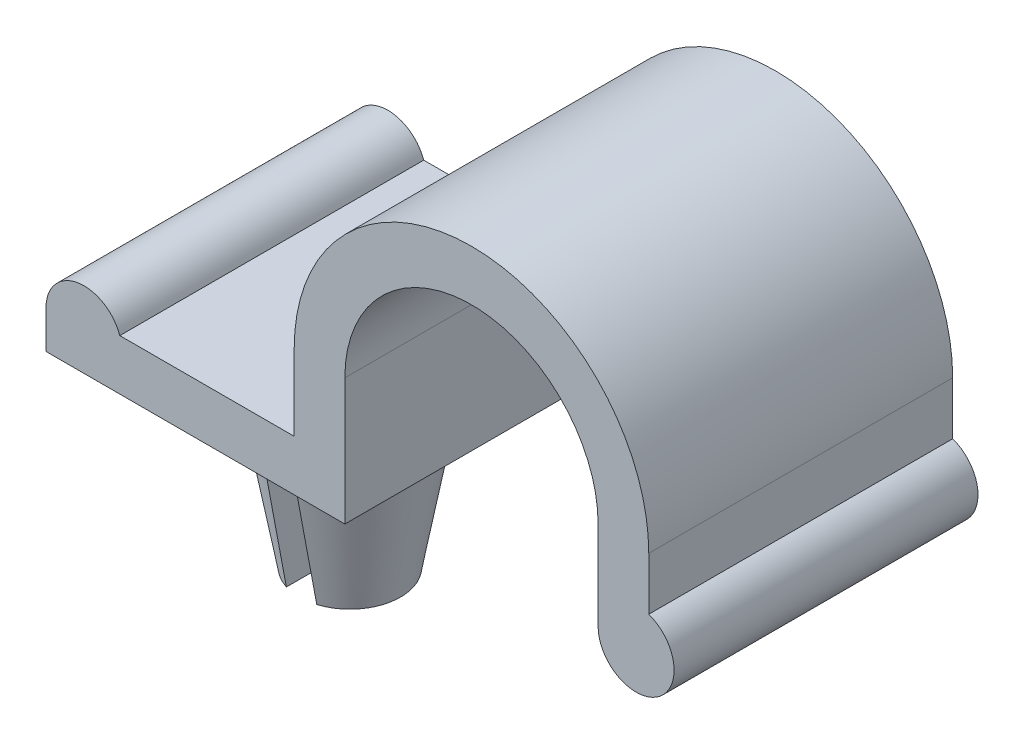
ISO-10303-21;
HEADER;
FILE_DESCRIPTION(('STEP AP214'),'2;1');
FILE_NAME('part.step','',(''),(''),'','','');
FILE_SCHEMA(('AUTOMOTIVE_DESIGN { 1 0 10303 214 1 1 1 1 }'));
ENDSEC;
DATA;
#1=APPLICATION_CONTEXT('core data for automotive mechanical design processes');
#2=APPLICATION_PROTOCOL_DEFINITION('international standard','automotive_design',2000,#1);
#3=PRODUCT_CONTEXT('',#1,'mechanical');
#4=PRODUCT('Part','Part','',(#3));
#5=PRODUCT_RELATED_PRODUCT_CATEGORY('part','',(#4));
#6=PRODUCT_DEFINITION_FORMATION('','',#4);
#7=PRODUCT_DEFINITION_CONTEXT('part definition',#1,'design');
#8=PRODUCT_DEFINITION('design','',#6,#7);
#9=PRODUCT_DEFINITION_SHAPE('','',#8);
#10=(LENGTH_UNIT() NAMED_UNIT(*) SI_UNIT(.MILLI.,.METRE.));
#11=(NAMED_UNIT(*) PLANE_ANGLE_UNIT() SI_UNIT($,.RADIAN.));
#12=(NAMED_UNIT(*) SI_UNIT($,.STERADIAN.) SOLID_ANGLE_UNIT());
#13=UNCERTAINTY_MEASURE_WITH_UNIT(LENGTH_MEASURE(1.E-05),#10,'distance_accuracy_value','');
#14=(GEOMETRIC_REPRESENTATION_CONTEXT(3) GLOBAL_UNCERTAINTY_ASSIGNED_CONTEXT((#13)) GLOBAL_UNIT_ASSIGNED_CONTEXT((#10,
#11,#12)) REPRESENTATION_CONTEXT('',''));
#15=CARTESIAN_POINT('',(0.,0.,0.));
#16=DIRECTION('',(0.,0.,1.));
#17=DIRECTION('',(1.,0.,0.));
#18=AXIS2_PLACEMENT_3D('',#15,#16,#17);
#19=CARTESIAN_POINT('',(-6.858,-7.874,0.));
#20=DIRECTION('',(0.,-1.,0.));
#21=DIRECTION('',(0.,0.,-1.));
#22=AXIS2_PLACEMENT_3D('',#19,#20,#21);
#23=PLANE('',#22);
#24=DIRECTION('',(0.,0.,1.));
#25=VECTOR('',#24,1.);
#26=CARTESIAN_POINT('',(-7.239,-7.874,-3.81));
#27=LINE('',#26,#25);
#28=CARTESIAN_POINT('',(-7.239,-7.874,-1.21150278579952));
#29=VERTEX_POINT('',#28);
#30=CARTESIAN_POINT('',(-7.239,-7.874,1.21150278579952));
#31=VERTEX_POINT('',#30);
#32=EDGE_CURVE('E432',#29,#31,#27,.T.);
#33=ORIENTED_EDGE('',*,*,#32,.T.);
#34=CARTESIAN_POINT('',(-6.858,-7.874,0.));
#35=DIRECTION('',(0.,-1.,0.));
#36=DIRECTION('',(0.,0.,-1.));
#37=AXIS2_PLACEMENT_3D('',#34,#35,#36);
#38=CIRCLE('',#37,1.27);
#39=EDGE_CURVE('E356',#31,#29,#38,.T.);
#40=ORIENTED_EDGE('',*,*,#39,.T.);
#41=EDGE_LOOP('',(#33,#40));
#42=FACE_BOUND('',#41,.T.);
#43=ADVANCED_FACE('F32',(#42),#23,.T.);
#44=CARTESIAN_POINT('',(-6.858,-7.874,0.));
#45=DIRECTION('',(0.,1.,0.));
#46=DIRECTION('',(0.,0.,1.));
#47=AXIS2_PLACEMENT_3D('',#44,#45,#46);
#48=CONICAL_SURFACE('',#47,1.27,0.179853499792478);
#49=CARTESIAN_POINT('',(-7.239,-9.73878944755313,-0.849412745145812));
#50=CARTESIAN_POINT('',(-7.239,-9.48062278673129,-0.900807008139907));
#51=CARTESIAN_POINT('',(-7.239,-9.22232851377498,-0.951552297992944));
#52=CARTESIAN_POINT('',(-7.239,-8.7055574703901,-1.05209980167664));
#53=CARTESIAN_POINT('',(-7.239,-8.4470807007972,-1.10190201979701));
#54=CARTESIAN_POINT('',(-7.239,-7.96393825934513,-1.1944225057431));
#55=CARTESIAN_POINT('',(-7.239,-7.73928633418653,-1.2372128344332));
#56=CARTESIAN_POINT('',(-7.239,-7.14364629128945,-1.35021271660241));
#57=CARTESIAN_POINT('',(-7.239,-6.77260404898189,-1.42013701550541));
#58=CARTESIAN_POINT('',(-7.239,-6.03041303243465,-1.55941958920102));
#59=CARTESIAN_POINT('',(-7.239,-5.65926425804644,-1.62877786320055));
#60=CARTESIAN_POINT('',(-7.239,-4.58924213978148,-1.82817101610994));
#61=CARTESIAN_POINT('',(-7.239,-3.89027873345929,-1.95772240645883));
#62=CARTESIAN_POINT('',(-7.239,-2.49221927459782,-2.21610859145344));
#63=CARTESIAN_POINT('',(-7.23900000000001,-1.79312322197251,-2.34494338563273));
#64=CARTESIAN_POINT('',(-7.23900000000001,-0.394858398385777,-2.60217341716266));
#65=CARTESIAN_POINT('',(-7.23900000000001,0.304310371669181,-2.73056865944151));
#66=CARTESIAN_POINT('',(-7.23900000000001,1.7027014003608,-2.98706215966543));
#67=CARTESIAN_POINT('',(-7.23900000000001,2.40192365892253,-3.11516041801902));
#68=CARTESIAN_POINT('',(-7.23900000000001,3.10116007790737,-3.24318091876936));
#69=B_SPLINE_CURVE_WITH_KNOTS('',3,(#49,#50,#51,#52,#53,#54,#55,#56,#57,#58,#59,#60,#61,#62,#63,
#64,#65,#66,#67,#68),.UNSPECIFIED.,.F.,.F.,(4,2,2,2,2,2,2,2,2,4),(0.,0.789694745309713,
1.57938589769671,2.26545823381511,3.39817786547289,4.53089908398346,6.66350237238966,
8.7961070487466,10.9286877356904,13.0612654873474),.UNSPECIFIED.);
#70=CARTESIAN_POINT('',(-7.239,-5.08,-1.73669888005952));
#71=VERTEX_POINT('',#70);
#72=EDGE_CURVE('E339',#29,#71,#69,.T.);
#73=ORIENTED_EDGE('',*,*,#72,.F.);
#74=ORIENTED_EDGE('',*,*,#39,.F.);
#75=CARTESIAN_POINT('',(-7.239,-9.73878944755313,0.849412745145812));
#76=CARTESIAN_POINT('',(-7.239,-9.48062278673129,0.900807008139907));
#77=CARTESIAN_POINT('',(-7.239,-9.22232851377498,0.951552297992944));
#78=CARTESIAN_POINT('',(-7.239,-8.7055574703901,1.05209980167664));
#79=CARTESIAN_POINT('',(-7.239,-8.4470807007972,1.10190201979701));
#80=CARTESIAN_POINT('',(-7.239,-7.96393825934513,1.1944225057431));
#81=CARTESIAN_POINT('',(-7.239,-7.73928633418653,1.2372128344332));
#82=CARTESIAN_POINT('',(-7.239,-7.14364629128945,1.35021271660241));
#83=CARTESIAN_POINT('',(-7.239,-6.77260404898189,1.42013701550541));
#84=CARTESIAN_POINT('',(-7.239,-6.03041303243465,1.55941958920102));
#85=CARTESIAN_POINT('',(-7.239,-5.65926425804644,1.62877786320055));
#86=CARTESIAN_POINT('',(-7.239,-4.58924213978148,1.82817101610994));
#87=CARTESIAN_POINT('',(-7.239,-3.89027873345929,1.95772240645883));
#88=CARTESIAN_POINT('',(-7.239,-2.49221927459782,2.21610859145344));
#89=CARTESIAN_POINT('',(-7.23900000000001,-1.79312322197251,2.34494338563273));
#90=CARTESIAN_POINT('',(-7.23900000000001,-0.394858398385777,2.60217341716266));
#91=CARTESIAN_POINT('',(-7.23900000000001,0.304310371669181,2.73056865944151));
#92=CARTESIAN_POINT('',(-7.23900000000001,1.7027014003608,2.98706215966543));
#93=CARTESIAN_POINT('',(-7.23900000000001,2.40192365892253,3.11516041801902));
#94=CARTESIAN_POINT('',(-7.23900000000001,3.10116007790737,3.24318091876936));
#95=B_SPLINE_CURVE_WITH_KNOTS('',3,(#75,#76,#77,#78,#79,#80,#81,#82,#83,#84,#85,#86,#87,#88,#89,
#90,#91,#92,#93,#94),.UNSPECIFIED.,.F.,.F.,(4,2,2,2,2,2,2,2,2,4),(0.,0.789694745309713,
1.57938589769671,2.26545823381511,3.39817786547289,4.53089908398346,6.66350237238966,
8.7961070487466,10.9286877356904,13.0612654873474),.UNSPECIFIED.);
#96=CARTESIAN_POINT('',(-7.239,-5.08,1.73669888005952));
#97=VERTEX_POINT('',#96);
#98=EDGE_CURVE('E326',#97,#31,#95,.F.);
#99=ORIENTED_EDGE('',*,*,#98,.F.);
#100=CARTESIAN_POINT('',(-6.858,-5.08,0.));
#101=DIRECTION('',(0.,-1.,0.));
#102=DIRECTION('',(0.,0.,-1.));
#103=AXIS2_PLACEMENT_3D('',#100,#101,#102);
#104=CIRCLE('',#103,1.778);
#105=EDGE_CURVE('E352',#97,#71,#104,.T.);
#106=ORIENTED_EDGE('',*,*,#105,.T.);
#107=EDGE_LOOP('',(#73,#74,#99,#106));
#108=FACE_BOUND('',#107,.T.);
#109=ADVANCED_FACE('F314',(#108),#48,.T.);
#110=CARTESIAN_POINT('',(-6.858,-3.175,0.));
#111=DIRECTION('',(0.,-1.,0.));
#112=DIRECTION('',(0.,0.,-1.));
#113=AXIS2_PLACEMENT_3D('',#110,#111,#112);
#114=CYLINDRICAL_SURFACE('',#113,1.778);
#115=DIRECTION('',(0.,-1.,0.));
#116=VECTOR('',#115,1.);
#117=CARTESIAN_POINT('',(-7.239,-3.175,-1.73669888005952));
#118=LINE('',#117,#116);
#119=CARTESIAN_POINT('',(-7.239,-4.826,-1.73669888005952));
#120=VERTEX_POINT('',#119);
#121=EDGE_CURVE('E335',#71,#120,#118,.F.);
#122=ORIENTED_EDGE('',*,*,#121,.F.);
#123=ORIENTED_EDGE('',*,*,#105,.F.);
#124=DIRECTION('',(0.,-1.,0.));
#125=VECTOR('',#124,1.);
#126=CARTESIAN_POINT('',(-7.239,-3.175,1.73669888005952));
#127=LINE('',#126,#125);
#128=CARTESIAN_POINT('',(-7.239,-4.826,1.73669888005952));
#129=VERTEX_POINT('',#128);
#130=EDGE_CURVE('E334',#129,#97,#127,.T.);
#131=ORIENTED_EDGE('',*,*,#130,.F.);
#132=CARTESIAN_POINT('',(-6.858,-4.826,0.));
#133=DIRECTION('',(0.,-1.,0.));
#134=DIRECTION('',(0.,0.,-1.));
#135=AXIS2_PLACEMENT_3D('',#132,#133,#134);
#136=CIRCLE('',#135,1.778);
#137=EDGE_CURVE('E350',#129,#120,#136,.T.);
#138=ORIENTED_EDGE('',*,*,#137,.T.);
#139=EDGE_LOOP('',(#122,#123,#131,#138));
#140=FACE_BOUND('',#139,.T.);
#141=ADVANCED_FACE('F419',(#140),#114,.T.);
#142=CARTESIAN_POINT('',(-5.08,-4.826,0.));
#143=DIRECTION('',(0.,1.,0.));
#144=DIRECTION('',(0.,0.,1.));
#145=AXIS2_PLACEMENT_3D('',#142,#143,#144);
#146=PLANE('',#145);
#147=DIRECTION('',(0.,0.,1.));
#148=VECTOR('',#147,1.);
#149=CARTESIAN_POINT('',(-7.239,-4.826,0.));
#150=LINE('',#149,#148);
#151=CARTESIAN_POINT('',(-7.239,-4.826,-1.47560665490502));
#152=VERTEX_POINT('',#151);
#153=EDGE_CURVE('E253',#120,#152,#150,.T.);
#154=ORIENTED_EDGE('',*,*,#153,.F.);
#155=ORIENTED_EDGE('',*,*,#137,.F.);
#156=CARTESIAN_POINT('',(-7.239,-4.826,1.47560665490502));
#157=VERTEX_POINT('',#156);
#158=EDGE_CURVE('E438',#157,#129,#150,.T.);
#159=ORIENTED_EDGE('',*,*,#158,.F.);
#160=CARTESIAN_POINT('',(-6.858,-4.826,0.));
#161=DIRECTION('',(0.,-1.,0.));
#162=DIRECTION('',(0.,0.,-1.));
#163=AXIS2_PLACEMENT_3D('',#160,#161,#162);
#164=CIRCLE('',#163,1.524);
#165=EDGE_CURVE('E348',#157,#152,#164,.T.);
#166=ORIENTED_EDGE('',*,*,#165,.T.);
#167=EDGE_LOOP('',(#154,#155,#159,#166));
#168=FACE_BOUND('',#167,.T.);
#169=ADVANCED_FACE('F454',(#168),#146,.T.);
#170=CARTESIAN_POINT('',(-3.175,-3.175,3.81));
#171=DIRECTION('',(0.,1.,0.));
#172=DIRECTION('',(-1.,0.,0.));
#173=AXIS2_PLACEMENT_3D('',#170,#171,#172);
#174=PLANE('',#173);
#175=CARTESIAN_POINT('',(-6.858,-3.175,0.));
#176=DIRECTION('',(0.,-1.,0.));
#177=DIRECTION('',(0.,0.,-1.));
#178=AXIS2_PLACEMENT_3D('',#175,#176,#177);
#179=CIRCLE('',#178,1.524);
#180=CARTESIAN_POINT('',(-6.858,-3.175,-1.524));
#181=VERTEX_POINT('',#180);
#182=EDGE_CURVE('E345',#181,#181,#179,.T.);
#183=ORIENTED_EDGE('',*,*,#182,.F.);
#184=EDGE_LOOP('',(#183));
#185=FACE_BOUND('',#184,.T.);
#186=DIRECTION('',(1.,0.,0.));
#187=VECTOR('',#186,1.);
#188=CARTESIAN_POINT('',(-3.175,-3.175,-3.81));
#189=LINE('',#188,#187);
#190=CARTESIAN_POINT('',(-10.668,-3.175,-3.81));
#191=VERTEX_POINT('',#190);
#192=CARTESIAN_POINT('',(-3.175,-3.175,-3.81));
#193=VERTEX_POINT('',#192);
#194=EDGE_CURVE('E159',#191,#193,#189,.T.);
#195=ORIENTED_EDGE('',*,*,#194,.T.);
#196=DIRECTION('',(0.,0.,-1.));
#197=VECTOR('',#196,1.);
#198=CARTESIAN_POINT('',(-3.175,-3.175,3.81));
#199=LINE('',#198,#197);
#200=CARTESIAN_POINT('',(-3.175,-3.175,3.81));
#201=VERTEX_POINT('',#200);
#202=EDGE_CURVE('E203',#201,#193,#199,.T.);
#203=ORIENTED_EDGE('',*,*,#202,.F.);
#204=DIRECTION('',(1.,0.,0.));
#205=VECTOR('',#204,1.);
#206=CARTESIAN_POINT('',(-3.175,-3.175,3.81));
#207=LINE('',#206,#205);
#208=CARTESIAN_POINT('',(-10.668,-3.175,3.81));
#209=VERTEX_POINT('',#208);
#210=EDGE_CURVE('E181',#209,#201,#207,.T.);
#211=ORIENTED_EDGE('',*,*,#210,.F.);
#212=DIRECTION('',(0.,0.,-1.));
#213=VECTOR('',#212,1.);
#214=CARTESIAN_POINT('',(-10.668,-3.175,3.81));
#215=LINE('',#214,#213);
#216=EDGE_CURVE('E155',#209,#191,#215,.T.);
#217=ORIENTED_EDGE('',*,*,#216,.T.);
#218=EDGE_LOOP('',(#195,#203,#211,#217));
#219=FACE_BOUND('',#218,.T.);
#220=ADVANCED_FACE('F34',(#185,#219),#174,.F.);
#221=CARTESIAN_POINT('',(-3.175,0.,3.81));
#222=DIRECTION('',(-1.,0.,0.));
#223=DIRECTION('',(0.,0.,1.));
#224=AXIS2_PLACEMENT_3D('',#221,#222,#223);
#225=PLANE('',#224);
#226=DIRECTION('',(0.,1.,0.));
#227=VECTOR('',#226,1.);
#228=CARTESIAN_POINT('',(-3.175,0.,-3.81));
#229=LINE('',#228,#227);
#230=CARTESIAN_POINT('',(-3.175,0.,-3.81));
#231=VERTEX_POINT('',#230);
#232=EDGE_CURVE('E162',#193,#231,#229,.T.);
#233=ORIENTED_EDGE('',*,*,#232,.T.);
#234=DIRECTION('',(0.,0.,-1.));
#235=VECTOR('',#234,1.);
#236=CARTESIAN_POINT('',(-3.175,0.,3.81));
#237=LINE('',#236,#235);
#238=CARTESIAN_POINT('',(-3.175,0.,3.81));
#239=VERTEX_POINT('',#238);
#240=EDGE_CURVE('E200',#239,#231,#237,.T.);
#241=ORIENTED_EDGE('',*,*,#240,.F.);
#242=DIRECTION('',(0.,1.,0.));
#243=VECTOR('',#242,1.);
#244=CARTESIAN_POINT('',(-3.175,0.,3.81));
#245=LINE('',#244,#243);
#246=EDGE_CURVE('E107',#201,#239,#245,.T.);
#247=ORIENTED_EDGE('',*,*,#246,.F.);
#248=ORIENTED_EDGE('',*,*,#202,.T.);
#249=EDGE_LOOP('',(#233,#241,#247,#248));
#250=FACE_BOUND('',#249,.T.);
#251=ADVANCED_FACE('F389',(#250),#225,.F.);
#252=CARTESIAN_POINT('',(0.,0.,3.81));
#253=DIRECTION('',(0.,0.,-1.));
#254=DIRECTION('',(-1.,0.,0.));
#255=AXIS2_PLACEMENT_3D('',#252,#253,#254);
#256=CYLINDRICAL_SURFACE('',#255,3.175);
#257=CARTESIAN_POINT('',(0.,0.,-3.81));
#258=DIRECTION('',(0.,0.,-1.));
#259=DIRECTION('',(1.,0.,0.));
#260=AXIS2_PLACEMENT_3D('',#257,#258,#259);
#261=CIRCLE('',#260,3.175);
#262=CARTESIAN_POINT('',(3.175,0.,-3.81));
#263=VERTEX_POINT('',#262);
#264=EDGE_CURVE('E165',#231,#263,#261,.T.);
#265=ORIENTED_EDGE('',*,*,#264,.T.);
#266=DIRECTION('',(0.,0.,-1.));
#267=VECTOR('',#266,1.);
#268=CARTESIAN_POINT('',(3.175,0.,3.81));
#269=LINE('',#268,#267);
#270=CARTESIAN_POINT('',(3.175,0.,3.81));
#271=VERTEX_POINT('',#270);
#272=EDGE_CURVE('E197',#271,#263,#269,.T.);
#273=ORIENTED_EDGE('',*,*,#272,.F.);
#274=CARTESIAN_POINT('',(0.,0.,3.81));
#275=DIRECTION('',(0.,0.,-1.));
#276=DIRECTION('',(1.,0.,0.));
#277=AXIS2_PLACEMENT_3D('',#274,#275,#276);
#278=CIRCLE('',#277,3.175);
#279=EDGE_CURVE('E361',#239,#271,#278,.T.);
#280=ORIENTED_EDGE('',*,*,#279,.F.);
#281=ORIENTED_EDGE('',*,*,#240,.T.);
#282=EDGE_LOOP('',(#265,#273,#280,#281));
#283=FACE_BOUND('',#282,.T.);
#284=ADVANCED_FACE('F392',(#283),#256,.F.);
#285=CARTESIAN_POINT('',(3.175,0.,3.81));
#286=DIRECTION('',(1.,0.,0.));
#287=DIRECTION('',(0.,1.,0.));
#288=AXIS2_PLACEMENT_3D('',#285,#286,#287);
#289=PLANE('',#288);
#290=DIRECTION('',(0.,-1.,0.));
#291=VECTOR('',#290,1.);
#292=CARTESIAN_POINT('',(3.175,0.,-3.81));
#293=LINE('',#292,#291);
#294=CARTESIAN_POINT('',(3.175,-2.2225,-3.81));
#295=VERTEX_POINT('',#294);
#296=EDGE_CURVE('E167',#263,#295,#293,.T.);
#297=ORIENTED_EDGE('',*,*,#296,.T.);
#298=DIRECTION('',(0.,0.,-1.));
#299=VECTOR('',#298,1.);
#300=CARTESIAN_POINT('',(3.175,-2.2225,3.81));
#301=LINE('',#300,#299);
#302=CARTESIAN_POINT('',(3.175,-2.2225,3.81));
#303=VERTEX_POINT('',#302);
#304=EDGE_CURVE('E194',#303,#295,#301,.T.);
#305=ORIENTED_EDGE('',*,*,#304,.F.);
#306=DIRECTION('',(0.,-1.,0.));
#307=VECTOR('',#306,1.);
#308=CARTESIAN_POINT('',(3.175,0.,3.81));
#309=LINE('',#308,#307);
#310=EDGE_CURVE('E363',#271,#303,#309,.T.);
#311=ORIENTED_EDGE('',*,*,#310,.F.);
#312=ORIENTED_EDGE('',*,*,#272,.T.);
#313=EDGE_LOOP('',(#297,#305,#311,#312));
#314=FACE_BOUND('',#313,.T.);
#315=ADVANCED_FACE('F397',(#314),#289,.F.);
#316=CARTESIAN_POINT('',(4.1275,-2.2225,3.81));
#317=DIRECTION('',(0.,0.,-1.));
#318=DIRECTION('',(-1.,0.,0.));
#319=AXIS2_PLACEMENT_3D('',#316,#317,#318);
#320=CYLINDRICAL_SURFACE('',#319,0.9525);
#321=CARTESIAN_POINT('',(4.1275,-2.2225,-3.81));
#322=DIRECTION('',(0.,0.,1.));
#323=DIRECTION('',(1.,0.,0.));
#324=AXIS2_PLACEMENT_3D('',#321,#322,#323);
#325=CIRCLE('',#324,0.9525);
#326=CARTESIAN_POINT('',(4.445,-1.32447438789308,-3.81));
#327=VERTEX_POINT('',#326);
#328=EDGE_CURVE('E169',#295,#327,#325,.T.);
#329=ORIENTED_EDGE('',*,*,#328,.T.);
#330=DIRECTION('',(0.,0.,-1.));
#331=VECTOR('',#330,1.);
#332=CARTESIAN_POINT('',(4.445,-1.32447438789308,3.81));
#333=LINE('',#332,#331);
#334=CARTESIAN_POINT('',(4.445,-1.32447438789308,3.81));
#335=VERTEX_POINT('',#334);
#336=EDGE_CURVE('E191',#335,#327,#333,.T.);
#337=ORIENTED_EDGE('',*,*,#336,.F.);
#338=CARTESIAN_POINT('',(4.1275,-2.2225,3.81));
#339=DIRECTION('',(0.,0.,1.));
#340=DIRECTION('',(1.,0.,0.));
#341=AXIS2_PLACEMENT_3D('',#338,#339,#340);
#342=CIRCLE('',#341,0.9525);
#343=EDGE_CURVE('E365',#303,#335,#342,.T.);
#344=ORIENTED_EDGE('',*,*,#343,.F.);
#345=ORIENTED_EDGE('',*,*,#304,.T.);
#346=EDGE_LOOP('',(#329,#337,#344,#345));
#347=FACE_BOUND('',#346,.T.);
#348=ADVANCED_FACE('F401',(#347),#320,.T.);
#349=CARTESIAN_POINT('',(4.445,0.,3.81));
#350=DIRECTION('',(-1.,0.,0.));
#351=DIRECTION('',(0.,0.,1.));
#352=AXIS2_PLACEMENT_3D('',#349,#350,#351);
#353=PLANE('',#352);
#354=DIRECTION('',(0.,1.,0.));
#355=VECTOR('',#354,1.);
#356=CARTESIAN_POINT('',(4.445,0.,-3.81));
#357=LINE('',#356,#355);
#358=CARTESIAN_POINT('',(4.445,0.,-3.81));
#359=VERTEX_POINT('',#358);
#360=EDGE_CURVE('E171',#327,#359,#357,.T.);
#361=ORIENTED_EDGE('',*,*,#360,.T.);
#362=DIRECTION('',(0.,0.,-1.));
#363=VECTOR('',#362,1.);
#364=CARTESIAN_POINT('',(4.445,0.,3.81));
#365=LINE('',#364,#363);
#366=CARTESIAN_POINT('',(4.445,0.,3.81));
#367=VERTEX_POINT('',#366);
#368=EDGE_CURVE('E188',#367,#359,#365,.T.);
#369=ORIENTED_EDGE('',*,*,#368,.F.);
#370=DIRECTION('',(0.,1.,0.));
#371=VECTOR('',#370,1.);
#372=CARTESIAN_POINT('',(4.445,0.,3.81));
#373=LINE('',#372,#371);
#374=EDGE_CURVE('E367',#335,#367,#373,.T.);
#375=ORIENTED_EDGE('',*,*,#374,.F.);
#376=ORIENTED_EDGE('',*,*,#336,.T.);
#377=EDGE_LOOP('',(#361,#369,#375,#376));
#378=FACE_BOUND('',#377,.T.);
#379=ADVANCED_FACE('F405',(#378),#353,.F.);
#380=CARTESIAN_POINT('',(0.,0.,3.81));
#381=DIRECTION('',(0.,0.,-1.));
#382=DIRECTION('',(-1.,0.,0.));
#383=AXIS2_PLACEMENT_3D('',#380,#381,#382);
#384=CYLINDRICAL_SURFACE('',#383,4.445);
#385=CARTESIAN_POINT('',(0.,0.,-3.81));
#386=DIRECTION('',(0.,0.,1.));
#387=DIRECTION('',(1.,0.,0.));
#388=AXIS2_PLACEMENT_3D('',#385,#386,#387);
#389=CIRCLE('',#388,4.445);
#390=CARTESIAN_POINT('',(-4.445,0.,-3.81));
#391=VERTEX_POINT('',#390);
#392=EDGE_CURVE('E173',#359,#391,#389,.T.);
#393=ORIENTED_EDGE('',*,*,#392,.T.);
#394=DIRECTION('',(0.,0.,-1.));
#395=VECTOR('',#394,1.);
#396=CARTESIAN_POINT('',(-4.445,0.,3.81));
#397=LINE('',#396,#395);
#398=CARTESIAN_POINT('',(-4.445,0.,3.81));
#399=VERTEX_POINT('',#398);
#400=EDGE_CURVE('E185',#399,#391,#397,.T.);
#401=ORIENTED_EDGE('',*,*,#400,.F.);
#402=CARTESIAN_POINT('',(0.,0.,3.81));
#403=DIRECTION('',(0.,0.,1.));
#404=DIRECTION('',(1.,0.,0.));
#405=AXIS2_PLACEMENT_3D('',#402,#403,#404);
#406=CIRCLE('',#405,4.445);
#407=EDGE_CURVE('E369',#367,#399,#406,.T.);
#408=ORIENTED_EDGE('',*,*,#407,.F.);
#409=ORIENTED_EDGE('',*,*,#368,.T.);
#410=EDGE_LOOP('',(#393,#401,#408,#409));
#411=FACE_BOUND('',#410,.T.);
#412=ADVANCED_FACE('F375',(#411),#384,.T.);
#413=CARTESIAN_POINT('',(-4.445,0.,3.81));
#414=DIRECTION('',(1.,0.,0.));
#415=DIRECTION('',(0.,0.,-1.));
#416=AXIS2_PLACEMENT_3D('',#413,#414,#415);
#417=PLANE('',#416);
#418=DIRECTION('',(0.,-1.,0.));
#419=VECTOR('',#418,1.);
#420=CARTESIAN_POINT('',(-4.445,0.,-3.81));
#421=LINE('',#420,#419);
#422=CARTESIAN_POINT('',(-4.445,-1.905,-3.81));
#423=VERTEX_POINT('',#422);
#424=EDGE_CURVE('E175',#391,#423,#421,.T.);
#425=ORIENTED_EDGE('',*,*,#424,.T.);
#426=DIRECTION('',(0.,0.,-1.));
#427=VECTOR('',#426,1.);
#428=CARTESIAN_POINT('',(-4.445,-1.905,3.81));
#429=LINE('',#428,#427);
#430=CARTESIAN_POINT('',(-4.445,-1.905,3.81));
#431=VERTEX_POINT('',#430);
#432=EDGE_CURVE('E150',#431,#423,#429,.T.);
#433=ORIENTED_EDGE('',*,*,#432,.F.);
#434=DIRECTION('',(0.,-1.,0.));
#435=VECTOR('',#434,1.);
#436=CARTESIAN_POINT('',(-4.445,0.,3.81));
#437=LINE('',#436,#435);
#438=EDGE_CURVE('E138',#399,#431,#437,.T.);
#439=ORIENTED_EDGE('',*,*,#438,.F.);
#440=ORIENTED_EDGE('',*,*,#400,.T.);
#441=EDGE_LOOP('',(#425,#433,#439,#440));
#442=FACE_BOUND('',#441,.T.);
#443=ADVANCED_FACE('F379',(#442),#417,.F.);
#444=CARTESIAN_POINT('',(-8.81747438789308,-1.905,3.81));
#445=DIRECTION('',(0.,-1.,0.));
#446=DIRECTION('',(1.,0.,0.));
#447=AXIS2_PLACEMENT_3D('',#444,#445,#446);
#448=PLANE('',#447);
#449=DIRECTION('',(-1.,0.,0.));
#450=VECTOR('',#449,1.);
#451=CARTESIAN_POINT('',(-8.81747438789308,-1.905,-3.81));
#452=LINE('',#451,#450);
#453=CARTESIAN_POINT('',(-8.81747438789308,-1.905,-3.81));
#454=VERTEX_POINT('',#453);
#455=EDGE_CURVE('E147',#423,#454,#452,.T.);
#456=ORIENTED_EDGE('',*,*,#455,.T.);
#457=DIRECTION('',(0.,0.,-1.));
#458=VECTOR('',#457,1.);
#459=CARTESIAN_POINT('',(-8.81747438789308,-1.905,3.81));
#460=LINE('',#459,#458);
#461=CARTESIAN_POINT('',(-8.81747438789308,-1.905,3.81));
#462=VERTEX_POINT('',#461);
#463=EDGE_CURVE('E144',#462,#454,#460,.T.);
#464=ORIENTED_EDGE('',*,*,#463,.F.);
#465=DIRECTION('',(-1.,0.,0.));
#466=VECTOR('',#465,1.);
#467=CARTESIAN_POINT('',(-8.81747438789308,-1.905,3.81));
#468=LINE('',#467,#466);
#469=EDGE_CURVE('E131',#431,#462,#468,.T.);
#470=ORIENTED_EDGE('',*,*,#469,.F.);
#471=ORIENTED_EDGE('',*,*,#432,.T.);
#472=EDGE_LOOP('',(#456,#464,#470,#471));
#473=FACE_BOUND('',#472,.T.);
#474=ADVANCED_FACE('F145',(#473),#448,.F.);
#475=CARTESIAN_POINT('',(-9.7155,-2.2225,3.81));
#476=DIRECTION('',(0.,0.,-1.));
#477=DIRECTION('',(-1.,0.,0.));
#478=AXIS2_PLACEMENT_3D('',#475,#476,#477);
#479=CYLINDRICAL_SURFACE('',#478,0.952499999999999);
#480=CARTESIAN_POINT('',(-9.7155,-2.2225,-3.81));
#481=DIRECTION('',(0.,0.,1.));
#482=DIRECTION('',(1.,0.,0.));
#483=AXIS2_PLACEMENT_3D('',#480,#481,#482);
#484=CIRCLE('',#483,0.952499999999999);
#485=CARTESIAN_POINT('',(-10.668,-2.2225,-3.81));
#486=VERTEX_POINT('',#485);
#487=EDGE_CURVE('E178',#454,#486,#484,.T.);
#488=ORIENTED_EDGE('',*,*,#487,.T.);
#489=DIRECTION('',(0.,0.,-1.));
#490=VECTOR('',#489,1.);
#491=CARTESIAN_POINT('',(-10.668,-2.2225,3.81));
#492=LINE('',#491,#490);
#493=CARTESIAN_POINT('',(-10.668,-2.2225,3.81));
#494=VERTEX_POINT('',#493);
#495=EDGE_CURVE('E151',#494,#486,#492,.T.);
#496=ORIENTED_EDGE('',*,*,#495,.F.);
#497=CARTESIAN_POINT('',(-9.7155,-2.2225,3.81));
#498=DIRECTION('',(0.,0.,1.));
#499=DIRECTION('',(1.,0.,0.));
#500=AXIS2_PLACEMENT_3D('',#497,#498,#499);
#501=CIRCLE('',#500,0.952499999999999);
#502=EDGE_CURVE('E135',#462,#494,#501,.T.);
#503=ORIENTED_EDGE('',*,*,#502,.F.);
#504=ORIENTED_EDGE('',*,*,#463,.T.);
#505=EDGE_LOOP('',(#488,#496,#503,#504));
#506=FACE_BOUND('',#505,.T.);
#507=ADVANCED_FACE('F153',(#506),#479,.T.);
#508=CARTESIAN_POINT('',(-10.668,-3.175,3.81));
#509=DIRECTION('',(1.,0.,0.));
#510=DIRECTION('',(0.,0.,-1.));
#511=AXIS2_PLACEMENT_3D('',#508,#509,#510);
#512=PLANE('',#511);
#513=DIRECTION('',(0.,-1.,0.));
#514=VECTOR('',#513,1.);
#515=CARTESIAN_POINT('',(-10.668,-3.175,-3.81));
#516=LINE('',#515,#514);
#517=EDGE_CURVE('E98',#486,#191,#516,.T.);
#518=ORIENTED_EDGE('',*,*,#517,.T.);
#519=ORIENTED_EDGE('',*,*,#216,.F.);
#520=DIRECTION('',(0.,-1.,0.));
#521=VECTOR('',#520,1.);
#522=CARTESIAN_POINT('',(-10.668,-3.175,3.81));
#523=LINE('',#522,#521);
#524=EDGE_CURVE('E56',#494,#209,#523,.T.);
#525=ORIENTED_EDGE('',*,*,#524,.F.);
#526=ORIENTED_EDGE('',*,*,#495,.T.);
#527=EDGE_LOOP('',(#518,#519,#525,#526));
#528=FACE_BOUND('',#527,.T.);
#529=ADVANCED_FACE('F383',(#528),#512,.F.);
#530=CARTESIAN_POINT('',(-9.7155,-2.2225,3.81));
#531=DIRECTION('',(0.,0.,1.));
#532=DIRECTION('',(1.,0.,0.));
#533=AXIS2_PLACEMENT_3D('',#530,#531,#532);
#534=PLANE('',#533);
#535=ORIENTED_EDGE('',*,*,#210,.T.);
#536=ORIENTED_EDGE('',*,*,#246,.T.);
#537=ORIENTED_EDGE('',*,*,#279,.T.);
#538=ORIENTED_EDGE('',*,*,#310,.T.);
#539=ORIENTED_EDGE('',*,*,#343,.T.);
#540=ORIENTED_EDGE('',*,*,#374,.T.);
#541=ORIENTED_EDGE('',*,*,#407,.T.);
#542=ORIENTED_EDGE('',*,*,#438,.T.);
#543=ORIENTED_EDGE('',*,*,#469,.T.);
#544=ORIENTED_EDGE('',*,*,#502,.T.);
#545=ORIENTED_EDGE('',*,*,#524,.T.);
#546=EDGE_LOOP('',(#535,#536,#537,#538,#539,#540,#541,#542,#543,#544,#545));
#547=FACE_BOUND('',#546,.T.);
#548=ADVANCED_FACE('F133',(#547),#534,.T.);
#549=CARTESIAN_POINT('',(-9.7155,-2.2225,-3.81));
#550=DIRECTION('',(0.,0.,1.));
#551=DIRECTION('',(1.,0.,0.));
#552=AXIS2_PLACEMENT_3D('',#549,#550,#551);
#553=PLANE('',#552);
#554=ORIENTED_EDGE('',*,*,#194,.F.);
#555=ORIENTED_EDGE('',*,*,#517,.F.);
#556=ORIENTED_EDGE('',*,*,#487,.F.);
#557=ORIENTED_EDGE('',*,*,#455,.F.);
#558=ORIENTED_EDGE('',*,*,#424,.F.);
#559=ORIENTED_EDGE('',*,*,#392,.F.);
#560=ORIENTED_EDGE('',*,*,#360,.F.);
#561=ORIENTED_EDGE('',*,*,#328,.F.);
#562=ORIENTED_EDGE('',*,*,#296,.F.);
#563=ORIENTED_EDGE('',*,*,#264,.F.);
#564=ORIENTED_EDGE('',*,*,#232,.F.);
#565=EDGE_LOOP('',(#554,#555,#556,#557,#558,#559,#560,#561,#562,#563,#564));
#566=FACE_BOUND('',#565,.T.);
#567=ADVANCED_FACE('F382',(#566),#553,.F.);
#568=DIRECTION('',(0.,0.,1.));
#569=VECTOR('',#568,1.);
#570=CARTESIAN_POINT('',(-6.477,-7.874,-3.81));
#571=LINE('',#570,#569);
#572=CARTESIAN_POINT('',(-6.477,-7.874,-1.21150278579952));
#573=VERTEX_POINT('',#572);
#574=CARTESIAN_POINT('',(-6.477,-7.874,1.21150278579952));
#575=VERTEX_POINT('',#574);
#576=EDGE_CURVE('E428',#573,#575,#571,.T.);
#577=ORIENTED_EDGE('',*,*,#576,.F.);
#578=EDGE_CURVE('E163',#573,#575,#38,.T.);
#579=ORIENTED_EDGE('',*,*,#578,.T.);
#580=EDGE_LOOP('',(#577,#579));
#581=FACE_BOUND('',#580,.T.);
#582=ADVANCED_FACE('F312',(#581),#23,.T.);
#583=CARTESIAN_POINT('',(-6.477,-9.73878944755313,-0.849412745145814));
#584=CARTESIAN_POINT('',(-6.477,-9.48062278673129,-0.900807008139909));
#585=CARTESIAN_POINT('',(-6.477,-9.22232851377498,-0.951552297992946));
#586=CARTESIAN_POINT('',(-6.477,-8.7055574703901,-1.05209980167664));
#587=CARTESIAN_POINT('',(-6.477,-8.4470807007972,-1.10190201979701));
#588=CARTESIAN_POINT('',(-6.477,-7.96393825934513,-1.1944225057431));
#589=CARTESIAN_POINT('',(-6.477,-7.73928633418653,-1.2372128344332));
#590=CARTESIAN_POINT('',(-6.477,-7.14364629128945,-1.35021271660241));
#591=CARTESIAN_POINT('',(-6.477,-6.77260404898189,-1.42013701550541));
#592=CARTESIAN_POINT('',(-6.477,-6.03041303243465,-1.55941958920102));
#593=CARTESIAN_POINT('',(-6.477,-5.65926425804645,-1.62877786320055));
#594=CARTESIAN_POINT('',(-6.477,-4.58924213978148,-1.82817101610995));
#595=CARTESIAN_POINT('',(-6.47700000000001,-3.89027873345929,-1.95772240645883));
#596=CARTESIAN_POINT('',(-6.47700000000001,-2.49221927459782,-2.21610859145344));
#597=CARTESIAN_POINT('',(-6.47700000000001,-1.7931232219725,-2.34494338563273));
#598=CARTESIAN_POINT('',(-6.47700000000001,-0.394858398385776,-2.60217341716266));
#599=CARTESIAN_POINT('',(-6.47700000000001,0.30431037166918,-2.73056865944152));
#600=CARTESIAN_POINT('',(-6.47700000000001,1.7027014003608,-2.98706215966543));
#601=CARTESIAN_POINT('',(-6.47700000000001,2.40192365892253,-3.11516041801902));
#602=CARTESIAN_POINT('',(-6.47700000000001,3.10116007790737,-3.24318091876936));
#603=B_SPLINE_CURVE_WITH_KNOTS('',3,(#583,#584,#585,#586,#587,#588,#589,#590,#591,#592,#593,
#594,#595,#596,#597,#598,#599,#600,#601,#602),.UNSPECIFIED.,.F.,.F.,(4,2,2,2,2,2,2,2,2,4),(0.,
0.789694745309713,1.57938589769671,2.26545823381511,3.39817786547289,4.53089908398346,
6.66350237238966,8.7961070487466,10.9286877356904,13.0612654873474),.UNSPECIFIED.);
#604=CARTESIAN_POINT('',(-6.47700000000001,-5.08,-1.73669888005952));
#605=VERTEX_POINT('',#604);
#606=EDGE_CURVE('E287',#605,#573,#603,.F.);
#607=ORIENTED_EDGE('',*,*,#606,.F.);
#608=CARTESIAN_POINT('',(-6.47700000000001,-5.08,1.73669888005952));
#609=VERTEX_POINT('',#608);
#610=EDGE_CURVE('E353',#605,#609,#104,.T.);
#611=ORIENTED_EDGE('',*,*,#610,.T.);
#612=CARTESIAN_POINT('',(-6.477,-9.73878944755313,0.849412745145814));
#613=CARTESIAN_POINT('',(-6.477,-9.48062278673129,0.900807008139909));
#614=CARTESIAN_POINT('',(-6.477,-9.22232851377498,0.951552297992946));
#615=CARTESIAN_POINT('',(-6.477,-8.7055574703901,1.05209980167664));
#616=CARTESIAN_POINT('',(-6.477,-8.4470807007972,1.10190201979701));
#617=CARTESIAN_POINT('',(-6.477,-7.96393825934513,1.1944225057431));
#618=CARTESIAN_POINT('',(-6.477,-7.73928633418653,1.2372128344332));
#619=CARTESIAN_POINT('',(-6.477,-7.14364629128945,1.35021271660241));
#620=CARTESIAN_POINT('',(-6.477,-6.77260404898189,1.42013701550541));
#621=CARTESIAN_POINT('',(-6.477,-6.03041303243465,1.55941958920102));
#622=CARTESIAN_POINT('',(-6.477,-5.65926425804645,1.62877786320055));
#623=CARTESIAN_POINT('',(-6.477,-4.58924213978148,1.82817101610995));
#624=CARTESIAN_POINT('',(-6.47700000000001,-3.89027873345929,1.95772240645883));
#625=CARTESIAN_POINT('',(-6.47700000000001,-2.49221927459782,2.21610859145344));
#626=CARTESIAN_POINT('',(-6.47700000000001,-1.7931232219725,2.34494338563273));
#627=CARTESIAN_POINT('',(-6.47700000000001,-0.394858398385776,2.60217341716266));
#628=CARTESIAN_POINT('',(-6.47700000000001,0.30431037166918,2.73056865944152));
#629=CARTESIAN_POINT('',(-6.47700000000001,1.7027014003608,2.98706215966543));
#630=CARTESIAN_POINT('',(-6.47700000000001,2.40192365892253,3.11516041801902));
#631=CARTESIAN_POINT('',(-6.47700000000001,3.10116007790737,3.24318091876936));
#632=B_SPLINE_CURVE_WITH_KNOTS('',3,(#612,#613,#614,#615,#616,#617,#618,#619,#620,#621,#622,
#623,#624,#625,#626,#627,#628,#629,#630,#631),.UNSPECIFIED.,.F.,.F.,(4,2,2,2,2,2,2,2,2,4),(0.,
0.789694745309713,1.57938589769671,2.26545823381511,3.39817786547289,4.53089908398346,
6.66350237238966,8.7961070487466,10.9286877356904,13.0612654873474),.UNSPECIFIED.);
#633=EDGE_CURVE('E292',#575,#609,#632,.T.);
#634=ORIENTED_EDGE('',*,*,#633,.F.);
#635=ORIENTED_EDGE('',*,*,#578,.F.);
#636=EDGE_LOOP('',(#607,#611,#634,#635));
#637=FACE_BOUND('',#636,.T.);
#638=ADVANCED_FACE('F306',(#637),#48,.T.);
#639=DIRECTION('',(0.,-1.,0.));
#640=VECTOR('',#639,1.);
#641=CARTESIAN_POINT('',(-6.47700000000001,-3.175,1.73669888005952));
#642=LINE('',#641,#640);
#643=CARTESIAN_POINT('',(-6.47700000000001,-4.826,1.73669888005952));
#644=VERTEX_POINT('',#643);
#645=EDGE_CURVE('E290',#609,#644,#642,.F.);
#646=ORIENTED_EDGE('',*,*,#645,.F.);
#647=ORIENTED_EDGE('',*,*,#610,.F.);
#648=DIRECTION('',(0.,-1.,0.));
#649=VECTOR('',#648,1.);
#650=CARTESIAN_POINT('',(-6.47700000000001,-3.175,-1.73669888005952));
#651=LINE('',#650,#649);
#652=CARTESIAN_POINT('',(-6.47700000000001,-4.826,-1.73669888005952));
#653=VERTEX_POINT('',#652);
#654=EDGE_CURVE('E284',#653,#605,#651,.T.);
#655=ORIENTED_EDGE('',*,*,#654,.F.);
#656=EDGE_CURVE('E283',#653,#644,#136,.T.);
#657=ORIENTED_EDGE('',*,*,#656,.T.);
#658=EDGE_LOOP('',(#646,#647,#655,#657));
#659=FACE_BOUND('',#658,.T.);
#660=ADVANCED_FACE('F311',(#659),#114,.T.);
#661=DIRECTION('',(0.,0.,-1.));
#662=VECTOR('',#661,1.);
#663=CARTESIAN_POINT('',(-6.47700000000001,-4.826,0.));
#664=LINE('',#663,#662);
#665=CARTESIAN_POINT('',(-6.47700000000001,-4.826,1.47560665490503));
#666=VERTEX_POINT('',#665);
#667=EDGE_CURVE('E286',#644,#666,#664,.T.);
#668=ORIENTED_EDGE('',*,*,#667,.F.);
#669=ORIENTED_EDGE('',*,*,#656,.F.);
#670=CARTESIAN_POINT('',(-6.47700000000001,-4.826,-1.47560665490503));
#671=VERTEX_POINT('',#670);
#672=EDGE_CURVE('E262',#671,#653,#664,.T.);
#673=ORIENTED_EDGE('',*,*,#672,.F.);
#674=EDGE_CURVE('E268',#671,#666,#164,.T.);
#675=ORIENTED_EDGE('',*,*,#674,.T.);
#676=EDGE_LOOP('',(#668,#669,#673,#675));
#677=FACE_BOUND('',#676,.T.);
#678=ADVANCED_FACE('F280',(#677),#146,.T.);
#679=CARTESIAN_POINT('',(-6.858,-3.175,0.));
#680=DIRECTION('',(0.,-1.,0.));
#681=DIRECTION('',(0.,0.,-1.));
#682=AXIS2_PLACEMENT_3D('',#679,#680,#681);
#683=CYLINDRICAL_SURFACE('',#682,1.524);
#684=DIRECTION('',(0.,-1.,0.));
#685=VECTOR('',#684,1.);
#686=CARTESIAN_POINT('',(-7.239,-3.175,1.47560665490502));
#687=LINE('',#686,#685);
#688=CARTESIAN_POINT('',(-7.239,-3.81,1.47560665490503));
#689=VERTEX_POINT('',#688);
#690=EDGE_CURVE('E11',#689,#157,#687,.T.);
#691=ORIENTED_EDGE('',*,*,#690,.F.);
#692=CARTESIAN_POINT('',(-6.47700000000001,-3.81,1.47560665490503));
#693=CARTESIAN_POINT('',(-6.47698025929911,-3.78892200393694,1.47558869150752));
#694=CARTESIAN_POINT('',(-6.47874778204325,-3.76785720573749,1.47605782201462));
#695=CARTESIAN_POINT('',(-6.48570229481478,-3.72637820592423,1.47783396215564));
#696=CARTESIAN_POINT('',(-6.49088233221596,-3.70596276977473,1.47913926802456));
#697=CARTESIAN_POINT('',(-6.50450730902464,-3.66631821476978,1.48245231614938));
#698=CARTESIAN_POINT('',(-6.512951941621,-3.64708898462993,1.48445999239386));
#699=CARTESIAN_POINT('',(-6.53284917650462,-3.61031280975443,1.48894503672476));
#700=CARTESIAN_POINT('',(-6.54430258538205,-3.59276631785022,1.49142253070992));
#701=CARTESIAN_POINT('',(-6.5701602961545,-3.55947598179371,1.4966298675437));
#702=CARTESIAN_POINT('',(-6.58461826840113,-3.54377444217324,1.49936371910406));
#703=CARTESIAN_POINT('',(-6.61595995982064,-3.51499085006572,1.50474087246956));
#704=CARTESIAN_POINT('',(-6.63284406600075,-3.50190921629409,1.50738415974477));
#705=CARTESIAN_POINT('',(-6.66884991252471,-3.47856392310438,1.51232684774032));
#706=CARTESIAN_POINT('',(-6.68799957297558,-3.46834210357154,1.51462093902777));
#707=CARTESIAN_POINT('',(-6.72781131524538,-3.4512790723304,1.51856064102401));
#708=CARTESIAN_POINT('',(-6.74847309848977,-3.44443719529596,1.52020637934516));
#709=CARTESIAN_POINT('',(-6.79027949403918,-3.43446392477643,1.52263563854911));
#710=CARTESIAN_POINT('',(-6.81140586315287,-3.43126021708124,1.52343594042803));
#711=CARTESIAN_POINT('',(-6.85391081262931,-3.42842721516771,1.52414263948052));
#712=CARTESIAN_POINT('',(-6.87528936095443,-3.42879747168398,1.52404914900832));
#713=CARTESIAN_POINT('',(-6.91718929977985,-3.43305001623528,1.52299125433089));
#714=CARTESIAN_POINT('',(-6.9377191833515,-3.43685416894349,1.52204622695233));
#715=CARTESIAN_POINT('',(-6.97783924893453,-3.44774088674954,1.51941401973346));
#716=CARTESIAN_POINT('',(-6.99742938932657,-3.4548235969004,1.51772680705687));
#717=CARTESIAN_POINT('',(-7.0353201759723,-3.47212968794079,1.51377014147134));
#718=CARTESIAN_POINT('',(-7.05360754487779,-3.48238091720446,1.5114955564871));
#719=CARTESIAN_POINT('',(-7.08822939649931,-3.5057117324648,1.5066109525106));
#720=CARTESIAN_POINT('',(-7.10456358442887,-3.51879174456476,1.50400088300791));
#721=CARTESIAN_POINT('',(-7.13528013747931,-3.54782586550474,1.49864660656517));
#722=CARTESIAN_POINT('',(-7.14959800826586,-3.56384795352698,1.49590068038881));
#723=CARTESIAN_POINT('',(-7.17536140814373,-3.59809917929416,1.49064790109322));
#724=CARTESIAN_POINT('',(-7.18680615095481,-3.61632891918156,1.48814111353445));
#725=CARTESIAN_POINT('',(-7.2065405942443,-3.65460747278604,1.48364377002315));
#726=CARTESIAN_POINT('',(-7.21481298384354,-3.67466554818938,1.48165606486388));
#727=CARTESIAN_POINT('',(-7.22783759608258,-3.71593754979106,1.47845929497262));
#728=CARTESIAN_POINT('',(-7.23259508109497,-3.73714969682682,1.47724906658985));
#729=CARTESIAN_POINT('',(-7.23667766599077,-3.76712126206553,1.47620465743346));
#730=CARTESIAN_POINT('',(-7.23754869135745,-3.77567940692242,1.47598075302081));
#731=CARTESIAN_POINT('',(-7.23870920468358,-3.79282367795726,1.4756818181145));
#732=CARTESIAN_POINT('',(-7.23899963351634,-3.80140973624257,1.47560654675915));
#733=CARTESIAN_POINT('',(-7.23900000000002,-3.81000000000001,1.47560665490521));
#734=B_SPLINE_CURVE_WITH_KNOTS('',3,(#692,#693,#694,#695,#696,#697,#698,#699,#700,#701,#702,
#703,#704,#705,#706,#707,#708,#709,#710,#711,#712,#713,#714,#715,#716,#717,#718,#719,#720,#721,
#722,#723,#724,#725,#726,#727,#728,#729,#730,#731,#732,#733),.UNSPECIFIED.,.F.,.F.,(4,2,2,2,2,2,
2,2,2,2,2,2,2,2,2,2,2,2,2,2,4),(0.,0.0631345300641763,0.126140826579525,0.189141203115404,
0.252158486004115,0.316416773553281,0.380685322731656,0.445850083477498,0.511002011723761,
0.574834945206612,0.638659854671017,0.701068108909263,0.763479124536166,0.826455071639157,
0.889440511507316,0.954124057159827,1.01882528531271,1.08387471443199,1.1488265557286,
1.17462559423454,1.20038279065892),.UNSPECIFIED.);
#735=CARTESIAN_POINT('',(-6.47700000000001,-3.81,1.47560665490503));
#736=VERTEX_POINT('',#735);
#737=EDGE_CURVE('E40',#736,#689,#734,.T.);
#738=ORIENTED_EDGE('',*,*,#737,.F.);
#739=DIRECTION('',(0.,-1.,0.));
#740=VECTOR('',#739,1.);
#741=CARTESIAN_POINT('',(-6.47700000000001,-3.175,1.47560665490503));
#742=LINE('',#741,#740);
#743=EDGE_CURVE('E235',#666,#736,#742,.F.);
#744=ORIENTED_EDGE('',*,*,#743,.F.);
#745=ORIENTED_EDGE('',*,*,#674,.F.);
#746=DIRECTION('',(0.,-1.,0.));
#747=VECTOR('',#746,1.);
#748=CARTESIAN_POINT('',(-6.47700000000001,-3.175,-1.47560665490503));
#749=LINE('',#748,#747);
#750=CARTESIAN_POINT('',(-6.47700000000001,-3.81,-1.47560665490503));
#751=VERTEX_POINT('',#750);
#752=EDGE_CURVE('E205',#751,#671,#749,.T.);
#753=ORIENTED_EDGE('',*,*,#752,.F.);
#754=CARTESIAN_POINT('',(-7.239,-3.81,-1.47560665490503));
#755=CARTESIAN_POINT('',(-7.2390197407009,-3.78892200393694,-1.47558869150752));
#756=CARTESIAN_POINT('',(-7.23725221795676,-3.76785720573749,-1.47605782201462));
#757=CARTESIAN_POINT('',(-7.23029770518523,-3.72637820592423,-1.47783396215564));
#758=CARTESIAN_POINT('',(-7.22511766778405,-3.70596276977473,-1.47913926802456));
#759=CARTESIAN_POINT('',(-7.21149269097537,-3.66631821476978,-1.48245231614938));
#760=CARTESIAN_POINT('',(-7.20304805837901,-3.64708898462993,-1.48445999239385));
#761=CARTESIAN_POINT('',(-7.18315082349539,-3.61031280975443,-1.48894503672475));
#762=CARTESIAN_POINT('',(-7.17169741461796,-3.59276631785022,-1.49142253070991));
#763=CARTESIAN_POINT('',(-7.14583970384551,-3.55947598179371,-1.4966298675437));
#764=CARTESIAN_POINT('',(-7.13138173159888,-3.54377444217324,-1.49936371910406));
#765=CARTESIAN_POINT('',(-7.10004004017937,-3.51499085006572,-1.50474087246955));
#766=CARTESIAN_POINT('',(-7.08315593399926,-3.50190921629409,-1.50738415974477));
#767=CARTESIAN_POINT('',(-7.0471500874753,-3.47856392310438,-1.51232684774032));
#768=CARTESIAN_POINT('',(-7.02800042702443,-3.46834210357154,-1.51462093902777));
#769=CARTESIAN_POINT('',(-6.98818868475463,-3.4512790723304,-1.51856064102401));
#770=CARTESIAN_POINT('',(-6.96752690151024,-3.44443719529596,-1.52020637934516));
#771=CARTESIAN_POINT('',(-6.92572050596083,-3.43446392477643,-1.52263563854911));
#772=CARTESIAN_POINT('',(-6.90459413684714,-3.43126021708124,-1.52343594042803));
#773=CARTESIAN_POINT('',(-6.8620891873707,-3.42842721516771,-1.52414263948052));
#774=CARTESIAN_POINT('',(-6.84071063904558,-3.42879747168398,-1.52404914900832));
#775=CARTESIAN_POINT('',(-6.79881070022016,-3.43305001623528,-1.52299125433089));
#776=CARTESIAN_POINT('',(-6.77828081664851,-3.43685416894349,-1.52204622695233));
#777=CARTESIAN_POINT('',(-6.73816075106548,-3.44774088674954,-1.51941401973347));
#778=CARTESIAN_POINT('',(-6.71857061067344,-3.4548235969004,-1.51772680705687));
#779=CARTESIAN_POINT('',(-6.68067982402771,-3.47212968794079,-1.51377014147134));
#780=CARTESIAN_POINT('',(-6.66239245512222,-3.48238091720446,-1.5114955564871));
#781=CARTESIAN_POINT('',(-6.6277706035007,-3.5057117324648,-1.5066109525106));
#782=CARTESIAN_POINT('',(-6.61143641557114,-3.51879174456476,-1.50400088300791));
#783=CARTESIAN_POINT('',(-6.58071986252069,-3.54782586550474,-1.49864660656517));
#784=CARTESIAN_POINT('',(-6.56640199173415,-3.56384795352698,-1.49590068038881));
#785=CARTESIAN_POINT('',(-6.54063859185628,-3.59809917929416,-1.49064790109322));
#786=CARTESIAN_POINT('',(-6.5291938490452,-3.61632891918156,-1.48814111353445));
#787=CARTESIAN_POINT('',(-6.50945940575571,-3.65460747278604,-1.48364377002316));
#788=CARTESIAN_POINT('',(-6.50118701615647,-3.67466554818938,-1.48165606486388));
#789=CARTESIAN_POINT('',(-6.48816240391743,-3.71593754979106,-1.47845929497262));
#790=CARTESIAN_POINT('',(-6.48340491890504,-3.73714969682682,-1.47724906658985));
#791=CARTESIAN_POINT('',(-6.47932233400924,-3.76712126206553,-1.47620465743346));
#792=CARTESIAN_POINT('',(-6.47845130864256,-3.77567940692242,-1.47598075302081));
#793=CARTESIAN_POINT('',(-6.47729079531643,-3.79282367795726,-1.47568181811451));
#794=CARTESIAN_POINT('',(-6.47700036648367,-3.80140973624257,-1.47560654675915));
#795=CARTESIAN_POINT('',(-6.47699999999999,-3.81000000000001,-1.47560665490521));
#796=B_SPLINE_CURVE_WITH_KNOTS('',3,(#754,#755,#756,#757,#758,#759,#760,#761,#762,#763,#764,
#765,#766,#767,#768,#769,#770,#771,#772,#773,#774,#775,#776,#777,#778,#779,#780,#781,#782,#783,
#784,#785,#786,#787,#788,#789,#790,#791,#792,#793,#794,#795),.UNSPECIFIED.,.F.,.F.,(4,2,2,2,2,2,
2,2,2,2,2,2,2,2,2,2,2,2,2,2,4),(0.,0.0631345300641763,0.126140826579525,0.189141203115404,
0.252158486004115,0.316416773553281,0.380685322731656,0.445850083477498,0.511002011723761,
0.57483494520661,0.638659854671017,0.701068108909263,0.763479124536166,0.826455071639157,
0.889440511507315,0.954124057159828,1.01882528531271,1.08387471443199,1.14882655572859,
1.17462559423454,1.20038279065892),.UNSPECIFIED.);
#797=CARTESIAN_POINT('',(-7.239,-3.81,-1.47560665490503));
#798=VERTEX_POINT('',#797);
#799=EDGE_CURVE('E207',#798,#751,#796,.T.);
#800=ORIENTED_EDGE('',*,*,#799,.F.);
#801=DIRECTION('',(0.,-1.,0.));
#802=VECTOR('',#801,1.);
#803=CARTESIAN_POINT('',(-7.239,-3.175,-1.47560665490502));
#804=LINE('',#803,#802);
#805=EDGE_CURVE('E215',#152,#798,#804,.F.);
#806=ORIENTED_EDGE('',*,*,#805,.F.);
#807=ORIENTED_EDGE('',*,*,#165,.F.);
#808=EDGE_LOOP('',(#691,#738,#744,#745,#753,#800,#806,#807));
#809=FACE_BOUND('',#808,.T.);
#810=ORIENTED_EDGE('',*,*,#182,.T.);
#811=EDGE_LOOP('',(#810));
#812=FACE_BOUND('',#811,.T.);
#813=ADVANCED_FACE('F217',(#809,#812),#683,.T.);
#814=CARTESIAN_POINT('',(-7.239,-7.874,-3.81));
#815=DIRECTION('',(-1.,0.,0.));
#816=DIRECTION('',(0.,-1.,0.));
#817=AXIS2_PLACEMENT_3D('',#814,#815,#816);
#818=PLANE('',#817);
#819=ORIENTED_EDGE('',*,*,#72,.T.);
#820=ORIENTED_EDGE('',*,*,#121,.T.);
#821=ORIENTED_EDGE('',*,*,#153,.T.);
#822=ORIENTED_EDGE('',*,*,#805,.T.);
#823=DIRECTION('',(0.,0.,1.));
#824=VECTOR('',#823,1.);
#825=CARTESIAN_POINT('',(-7.239,-3.81,-3.81));
#826=LINE('',#825,#824);
#827=EDGE_CURVE('E248',#798,#689,#826,.T.);
#828=ORIENTED_EDGE('',*,*,#827,.T.);
#829=ORIENTED_EDGE('',*,*,#690,.T.);
#830=ORIENTED_EDGE('',*,*,#158,.T.);
#831=ORIENTED_EDGE('',*,*,#130,.T.);
#832=ORIENTED_EDGE('',*,*,#98,.T.);
#833=ORIENTED_EDGE('',*,*,#32,.F.);
#834=EDGE_LOOP('',(#819,#820,#821,#822,#828,#829,#830,#831,#832,#833));
#835=FACE_BOUND('',#834,.T.);
#836=ADVANCED_FACE('F226',(#835),#818,.F.);
#837=CARTESIAN_POINT('',(-6.858,-3.81,-3.81));
#838=DIRECTION('',(0.,0.,1.));
#839=DIRECTION('',(1.,0.,0.));
#840=AXIS2_PLACEMENT_3D('',#837,#838,#839);
#841=CYLINDRICAL_SURFACE('',#840,0.380999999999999);
#842=ORIENTED_EDGE('',*,*,#799,.T.);
#843=DIRECTION('',(0.,0.,1.));
#844=VECTOR('',#843,1.);
#845=CARTESIAN_POINT('',(-6.47700000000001,-3.81,-3.81));
#846=LINE('',#845,#844);
#847=EDGE_CURVE('E47',#751,#736,#846,.T.);
#848=ORIENTED_EDGE('',*,*,#847,.T.);
#849=ORIENTED_EDGE('',*,*,#737,.T.);
#850=ORIENTED_EDGE('',*,*,#827,.F.);
#851=EDGE_LOOP('',(#842,#848,#849,#850));
#852=FACE_BOUND('',#851,.T.);
#853=ADVANCED_FACE('F221',(#852),#841,.F.);
#854=CARTESIAN_POINT('',(-6.477,-7.874,-3.81));
#855=DIRECTION('',(1.,0.,0.));
#856=DIRECTION('',(0.,1.,0.));
#857=AXIS2_PLACEMENT_3D('',#854,#855,#856);
#858=PLANE('',#857);
#859=ORIENTED_EDGE('',*,*,#633,.T.);
#860=ORIENTED_EDGE('',*,*,#645,.T.);
#861=ORIENTED_EDGE('',*,*,#667,.T.);
#862=ORIENTED_EDGE('',*,*,#743,.T.);
#863=ORIENTED_EDGE('',*,*,#847,.F.);
#864=ORIENTED_EDGE('',*,*,#752,.T.);
#865=ORIENTED_EDGE('',*,*,#672,.T.);
#866=ORIENTED_EDGE('',*,*,#654,.T.);
#867=ORIENTED_EDGE('',*,*,#606,.T.);
#868=ORIENTED_EDGE('',*,*,#576,.T.);
#869=EDGE_LOOP('',(#859,#860,#861,#862,#863,#864,#865,#866,#867,#868));
#870=FACE_BOUND('',#869,.T.);
#871=ADVANCED_FACE('F225',(#870),#858,.F.);
#872=CLOSED_SHELL('',(#43,#109,#141,#169,#220,#251,#284,#315,#348,#379,#412,#443,#474,#507,#529,
#548,#567,#582,#638,#660,#678,#813,#836,#853,#871));
#873=MANIFOLD_SOLID_BREP('B2',#872);
#874=ADVANCED_BREP_SHAPE_REPRESENTATION('',(#18,#873),#14);
#875=SHAPE_DEFINITION_REPRESENTATION(#9,#874);
ENDSEC;
END-ISO-10303-21;
